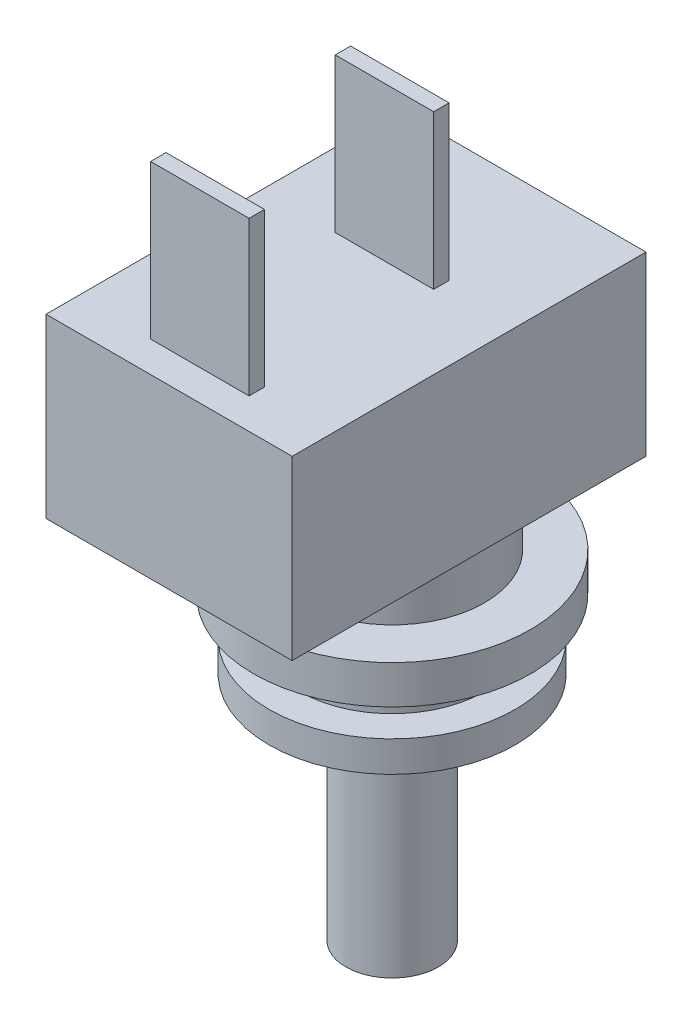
ISO-10303-21;
HEADER;
FILE_DESCRIPTION(('STEP AP214'),'2;1');
FILE_NAME('part.step','',(''),(''),'','','');
FILE_SCHEMA(('AUTOMOTIVE_DESIGN { 1 0 10303 214 1 1 1 1 }'));
ENDSEC;
DATA;
#1=APPLICATION_CONTEXT('core data for automotive mechanical design processes');
#2=APPLICATION_PROTOCOL_DEFINITION('international standard','automotive_design',2000,#1);
#3=PRODUCT_CONTEXT('',#1,'mechanical');
#4=PRODUCT('Part','Part','',(#3));
#5=PRODUCT_RELATED_PRODUCT_CATEGORY('part','',(#4));
#6=PRODUCT_DEFINITION_FORMATION('','',#4);
#7=PRODUCT_DEFINITION_CONTEXT('part definition',#1,'design');
#8=PRODUCT_DEFINITION('design','',#6,#7);
#9=PRODUCT_DEFINITION_SHAPE('','',#8);
#10=(LENGTH_UNIT() NAMED_UNIT(*) SI_UNIT(.MILLI.,.METRE.));
#11=(NAMED_UNIT(*) PLANE_ANGLE_UNIT() SI_UNIT($,.RADIAN.));
#12=(NAMED_UNIT(*) SI_UNIT($,.STERADIAN.) SOLID_ANGLE_UNIT());
#13=UNCERTAINTY_MEASURE_WITH_UNIT(LENGTH_MEASURE(1.E-05),#10,'distance_accuracy_value','');
#14=(GEOMETRIC_REPRESENTATION_CONTEXT(3) GLOBAL_UNCERTAINTY_ASSIGNED_CONTEXT((#13)) GLOBAL_UNIT_ASSIGNED_CONTEXT((#10,
#11,#12)) REPRESENTATION_CONTEXT('',''));
#15=CARTESIAN_POINT('',(0.,0.,0.));
#16=DIRECTION('',(0.,0.,1.));
#17=DIRECTION('',(1.,0.,0.));
#18=AXIS2_PLACEMENT_3D('',#15,#16,#17);
#19=CARTESIAN_POINT('',(8.,23.5,14.5));
#20=DIRECTION('',(0.,-1.,0.));
#21=DIRECTION('',(0.,0.,-1.));
#22=AXIS2_PLACEMENT_3D('',#19,#20,#21);
#23=PLANE('',#22);
#24=DIRECTION('',(0.,0.,-1.));
#25=VECTOR('',#24,1.);
#26=CARTESIAN_POINT('',(3.2,23.5,-0.5));
#27=LINE('',#26,#25);
#28=CARTESIAN_POINT('',(3.2,23.5,0.499999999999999));
#29=VERTEX_POINT('',#28);
#30=CARTESIAN_POINT('',(3.2,23.5,-0.5));
#31=VERTEX_POINT('',#30);
#32=EDGE_CURVE('E141',#29,#31,#27,.T.);
#33=ORIENTED_EDGE('',*,*,#32,.F.);
#34=DIRECTION('',(1.,0.,0.));
#35=VECTOR('',#34,1.);
#36=CARTESIAN_POINT('',(3.2,23.5,0.499999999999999));
#37=LINE('',#36,#35);
#38=CARTESIAN_POINT('',(-3.2,23.5,0.5));
#39=VERTEX_POINT('',#38);
#40=EDGE_CURVE('E154',#39,#29,#37,.T.);
#41=ORIENTED_EDGE('',*,*,#40,.F.);
#42=DIRECTION('',(0.,0.,1.));
#43=VECTOR('',#42,1.);
#44=CARTESIAN_POINT('',(-3.2,23.5,-0.5));
#45=LINE('',#44,#43);
#46=CARTESIAN_POINT('',(-3.2,23.5,-0.5));
#47=VERTEX_POINT('',#46);
#48=EDGE_CURVE('E163',#47,#39,#45,.T.);
#49=ORIENTED_EDGE('',*,*,#48,.F.);
#50=DIRECTION('',(-1.,0.,0.));
#51=VECTOR('',#50,1.);
#52=CARTESIAN_POINT('',(3.2,23.5,-0.5));
#53=LINE('',#52,#51);
#54=EDGE_CURVE('E144',#31,#47,#53,.T.);
#55=ORIENTED_EDGE('',*,*,#54,.F.);
#56=EDGE_LOOP('',(#33,#41,#49,#55));
#57=FACE_BOUND('',#56,.T.);
#58=DIRECTION('',(0.,0.,-1.));
#59=VECTOR('',#58,1.);
#60=CARTESIAN_POINT('',(8.,23.5,-8.5));
#61=LINE('',#60,#59);
#62=CARTESIAN_POINT('',(8.,23.5,14.5));
#63=VERTEX_POINT('',#62);
#64=CARTESIAN_POINT('',(8.,23.5,-8.5));
#65=VERTEX_POINT('',#64);
#66=EDGE_CURVE('E180',#63,#65,#61,.T.);
#67=ORIENTED_EDGE('',*,*,#66,.T.);
#68=DIRECTION('',(-1.,0.,0.));
#69=VECTOR('',#68,1.);
#70=CARTESIAN_POINT('',(8.,23.5,-8.5));
#71=LINE('',#70,#69);
#72=CARTESIAN_POINT('',(-8.,23.5,-8.5));
#73=VERTEX_POINT('',#72);
#74=EDGE_CURVE('E183',#65,#73,#71,.T.);
#75=ORIENTED_EDGE('',*,*,#74,.T.);
#76=DIRECTION('',(0.,0.,1.));
#77=VECTOR('',#76,1.);
#78=CARTESIAN_POINT('',(-8.,23.5,-8.5));
#79=LINE('',#78,#77);
#80=CARTESIAN_POINT('',(-7.99999999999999,23.5,14.5));
#81=VERTEX_POINT('',#80);
#82=EDGE_CURVE('E186',#73,#81,#79,.T.);
#83=ORIENTED_EDGE('',*,*,#82,.T.);
#84=DIRECTION('',(1.,0.,0.));
#85=VECTOR('',#84,1.);
#86=CARTESIAN_POINT('',(8.,23.5,14.5));
#87=LINE('',#86,#85);
#88=EDGE_CURVE('E188',#81,#63,#87,.T.);
#89=ORIENTED_EDGE('',*,*,#88,.T.);
#90=EDGE_LOOP('',(#67,#75,#83,#89));
#91=FACE_BOUND('',#90,.T.);
#92=DIRECTION('',(0.,0.,-1.));
#93=VECTOR('',#92,1.);
#94=CARTESIAN_POINT('',(3.2,23.5,12.5));
#95=LINE('',#94,#93);
#96=CARTESIAN_POINT('',(3.2,23.5,12.5));
#97=VERTEX_POINT('',#96);
#98=CARTESIAN_POINT('',(3.2,23.5,11.5));
#99=VERTEX_POINT('',#98);
#100=EDGE_CURVE('E140',#97,#99,#95,.T.);
#101=ORIENTED_EDGE('',*,*,#100,.F.);
#102=DIRECTION('',(1.,0.,0.));
#103=VECTOR('',#102,1.);
#104=CARTESIAN_POINT('',(3.2,23.5,12.5));
#105=LINE('',#104,#103);
#106=CARTESIAN_POINT('',(-3.2,23.5,12.5));
#107=VERTEX_POINT('',#106);
#108=EDGE_CURVE('E137',#107,#97,#105,.T.);
#109=ORIENTED_EDGE('',*,*,#108,.F.);
#110=DIRECTION('',(0.,0.,1.));
#111=VECTOR('',#110,1.);
#112=CARTESIAN_POINT('',(-3.2,23.5,12.5));
#113=LINE('',#112,#111);
#114=CARTESIAN_POINT('',(-3.2,23.5,11.5));
#115=VERTEX_POINT('',#114);
#116=EDGE_CURVE('E51',#115,#107,#113,.T.);
#117=ORIENTED_EDGE('',*,*,#116,.F.);
#118=DIRECTION('',(-1.,0.,0.));
#119=VECTOR('',#118,1.);
#120=CARTESIAN_POINT('',(3.2,23.5,11.5));
#121=LINE('',#120,#119);
#122=EDGE_CURVE('E46',#99,#115,#121,.T.);
#123=ORIENTED_EDGE('',*,*,#122,.F.);
#124=EDGE_LOOP('',(#101,#109,#117,#123));
#125=FACE_BOUND('',#124,.T.);
#126=ADVANCED_FACE('F31',(#57,#91,#125),#23,.F.);
#127=CARTESIAN_POINT('',(0.,7.,0.));
#128=DIRECTION('',(0.,1.,0.));
#129=DIRECTION('',(0.,0.,1.));
#130=AXIS2_PLACEMENT_3D('',#127,#128,#129);
#131=PLANE('',#130);
#132=CARTESIAN_POINT('',(0.,7.,0.));
#133=DIRECTION('',(0.,1.,0.));
#134=DIRECTION('',(0.,0.,1.));
#135=AXIS2_PLACEMENT_3D('',#132,#133,#134);
#136=CIRCLE('',#135,9.);
#137=CARTESIAN_POINT('',(0.,7.,9.));
#138=VERTEX_POINT('',#137);
#139=EDGE_CURVE('E216',#138,#138,#136,.T.);
#140=ORIENTED_EDGE('',*,*,#139,.T.);
#141=EDGE_LOOP('',(#140));
#142=FACE_BOUND('',#141,.T.);
#143=CARTESIAN_POINT('',(0.,7.,0.));
#144=DIRECTION('',(0.,1.,0.));
#145=DIRECTION('',(0.,0.,1.));
#146=AXIS2_PLACEMENT_3D('',#143,#144,#145);
#147=CIRCLE('',#146,6.);
#148=CARTESIAN_POINT('',(0.,7.,6.));
#149=VERTEX_POINT('',#148);
#150=EDGE_CURVE('E209',#149,#149,#147,.T.);
#151=ORIENTED_EDGE('',*,*,#150,.F.);
#152=EDGE_LOOP('',(#151));
#153=FACE_BOUND('',#152,.T.);
#154=ADVANCED_FACE('F264',(#142,#153),#131,.T.);
#155=CARTESIAN_POINT('',(0.,2.,0.));
#156=DIRECTION('',(0.,1.,0.));
#157=DIRECTION('',(0.,0.,1.));
#158=AXIS2_PLACEMENT_3D('',#155,#156,#157);
#159=PLANE('',#158);
#160=CARTESIAN_POINT('',(0.,2.,0.));
#161=DIRECTION('',(0.,1.,0.));
#162=DIRECTION('',(0.,0.,1.));
#163=AXIS2_PLACEMENT_3D('',#160,#161,#162);
#164=CIRCLE('',#163,8.);
#165=CARTESIAN_POINT('',(0.,2.,8.));
#166=VERTEX_POINT('',#165);
#167=EDGE_CURVE('E240',#166,#166,#164,.T.);
#168=ORIENTED_EDGE('',*,*,#167,.T.);
#169=EDGE_LOOP('',(#168));
#170=FACE_BOUND('',#169,.T.);
#171=CARTESIAN_POINT('',(0.,2.,0.));
#172=DIRECTION('',(0.,1.,0.));
#173=DIRECTION('',(0.,0.,1.));
#174=AXIS2_PLACEMENT_3D('',#171,#172,#173);
#175=CIRCLE('',#174,6.);
#176=CARTESIAN_POINT('',(0.,2.,6.));
#177=VERTEX_POINT('',#176);
#178=EDGE_CURVE('E219',#177,#177,#175,.T.);
#179=ORIENTED_EDGE('',*,*,#178,.F.);
#180=EDGE_LOOP('',(#179));
#181=FACE_BOUND('',#180,.T.);
#182=ADVANCED_FACE('F259',(#170,#181),#159,.T.);
#183=CARTESIAN_POINT('',(0.,0.,0.));
#184=DIRECTION('',(0.,1.,0.));
#185=DIRECTION('',(0.,0.,1.));
#186=AXIS2_PLACEMENT_3D('',#183,#184,#185);
#187=PLANE('',#186);
#188=CARTESIAN_POINT('',(0.,0.,0.));
#189=DIRECTION('',(0.,-1.,0.));
#190=DIRECTION('',(0.,0.,-1.));
#191=AXIS2_PLACEMENT_3D('',#188,#189,#190);
#192=CIRCLE('',#191,3.5);
#193=CARTESIAN_POINT('',(0.,0.,-3.5));
#194=VERTEX_POINT('',#193);
#195=EDGE_CURVE('E230',#194,#194,#192,.T.);
#196=ORIENTED_EDGE('',*,*,#195,.T.);
#197=EDGE_LOOP('',(#196));
#198=FACE_BOUND('',#197,.T.);
#199=CARTESIAN_POINT('',(0.,0.,0.));
#200=DIRECTION('',(0.,1.,0.));
#201=DIRECTION('',(0.,0.,1.));
#202=AXIS2_PLACEMENT_3D('',#199,#200,#201);
#203=CIRCLE('',#202,3.);
#204=CARTESIAN_POINT('',(0.,0.,3.));
#205=VERTEX_POINT('',#204);
#206=EDGE_CURVE('E11',#205,#205,#203,.F.);
#207=ORIENTED_EDGE('',*,*,#206,.F.);
#208=EDGE_LOOP('',(#207));
#209=FACE_BOUND('',#208,.T.);
#210=ADVANCED_FACE('F251',(#198,#209),#187,.F.);
#211=CARTESIAN_POINT('',(0.,0.,0.));
#212=DIRECTION('',(0.,1.,0.));
#213=DIRECTION('',(0.,0.,1.));
#214=AXIS2_PLACEMENT_3D('',#211,#212,#213);
#215=CIRCLE('',#214,8.);
#216=CARTESIAN_POINT('',(0.,0.,8.));
#217=VERTEX_POINT('',#216);
#218=EDGE_CURVE('E239',#217,#217,#215,.T.);
#219=ORIENTED_EDGE('',*,*,#218,.F.);
#220=EDGE_LOOP('',(#219));
#221=FACE_BOUND('',#220,.T.);
#222=CARTESIAN_POINT('',(0.,0.,0.));
#223=DIRECTION('',(0.,1.,0.));
#224=DIRECTION('',(0.,0.,1.));
#225=AXIS2_PLACEMENT_3D('',#222,#223,#224);
#226=CIRCLE('',#225,6.);
#227=CARTESIAN_POINT('',(0.,0.,6.));
#228=VERTEX_POINT('',#227);
#229=EDGE_CURVE('E39',#228,#228,#226,.F.);
#230=ORIENTED_EDGE('',*,*,#229,.F.);
#231=EDGE_LOOP('',(#230));
#232=FACE_BOUND('',#231,.T.);
#233=ADVANCED_FACE('F249',(#221,#232),#187,.F.);
#234=CARTESIAN_POINT('',(0.,2.,0.));
#235=DIRECTION('',(0.,-1.,0.));
#236=DIRECTION('',(0.,0.,-1.));
#237=AXIS2_PLACEMENT_3D('',#234,#235,#236);
#238=CYLINDRICAL_SURFACE('',#237,8.);
#239=ORIENTED_EDGE('',*,*,#167,.F.);
#240=EDGE_LOOP('',(#239));
#241=FACE_BOUND('',#240,.T.);
#242=ORIENTED_EDGE('',*,*,#218,.T.);
#243=EDGE_LOOP('',(#242));
#244=FACE_BOUND('',#243,.T.);
#245=ADVANCED_FACE('F33',(#241,#244),#238,.T.);
#246=CARTESIAN_POINT('',(0.,-1.,0.));
#247=DIRECTION('',(0.,-1.,0.));
#248=DIRECTION('',(0.,0.,-1.));
#249=AXIS2_PLACEMENT_3D('',#246,#247,#248);
#250=PLANE('',#249);
#251=CARTESIAN_POINT('',(0.,-1.,0.));
#252=DIRECTION('',(0.,-1.,0.));
#253=DIRECTION('',(0.,0.,-1.));
#254=AXIS2_PLACEMENT_3D('',#251,#252,#253);
#255=CIRCLE('',#254,6.);
#256=CARTESIAN_POINT('',(0.,-1.,-6.));
#257=VERTEX_POINT('',#256);
#258=EDGE_CURVE('E234',#257,#257,#255,.T.);
#259=ORIENTED_EDGE('',*,*,#258,.T.);
#260=EDGE_LOOP('',(#259));
#261=FACE_BOUND('',#260,.T.);
#262=CARTESIAN_POINT('',(0.,-1.,0.));
#263=DIRECTION('',(0.,-1.,0.));
#264=DIRECTION('',(0.,0.,-1.));
#265=AXIS2_PLACEMENT_3D('',#262,#263,#264);
#266=CIRCLE('',#265,3.5);
#267=CARTESIAN_POINT('',(0.,-1.,-3.5));
#268=VERTEX_POINT('',#267);
#269=EDGE_CURVE('E231',#268,#268,#266,.T.);
#270=ORIENTED_EDGE('',*,*,#269,.F.);
#271=EDGE_LOOP('',(#270));
#272=FACE_BOUND('',#271,.T.);
#273=ADVANCED_FACE('F257',(#261,#272),#250,.T.);
#274=CARTESIAN_POINT('',(0.,-1.,0.));
#275=DIRECTION('',(0.,1.,0.));
#276=DIRECTION('',(0.,0.,1.));
#277=AXIS2_PLACEMENT_3D('',#274,#275,#276);
#278=CYLINDRICAL_SURFACE('',#277,6.);
#279=ORIENTED_EDGE('',*,*,#258,.F.);
#280=EDGE_LOOP('',(#279));
#281=FACE_BOUND('',#280,.T.);
#282=ORIENTED_EDGE('',*,*,#229,.T.);
#283=EDGE_LOOP('',(#282));
#284=FACE_BOUND('',#283,.T.);
#285=ADVANCED_FACE('F247',(#281,#284),#278,.T.);
#286=CARTESIAN_POINT('',(0.,-1.,0.));
#287=DIRECTION('',(0.,1.,0.));
#288=DIRECTION('',(0.,0.,1.));
#289=AXIS2_PLACEMENT_3D('',#286,#287,#288);
#290=CYLINDRICAL_SURFACE('',#289,3.5);
#291=ORIENTED_EDGE('',*,*,#269,.T.);
#292=EDGE_LOOP('',(#291));
#293=FACE_BOUND('',#292,.T.);
#294=ORIENTED_EDGE('',*,*,#195,.F.);
#295=EDGE_LOOP('',(#294));
#296=FACE_BOUND('',#295,.T.);
#297=ADVANCED_FACE('F320',(#293,#296),#290,.F.);
#298=CARTESIAN_POINT('',(0.,-15.,0.));
#299=DIRECTION('',(0.,1.,0.));
#300=DIRECTION('',(0.,0.,1.));
#301=AXIS2_PLACEMENT_3D('',#298,#299,#300);
#302=CYLINDRICAL_SURFACE('',#301,3.);
#303=CARTESIAN_POINT('',(0.,-15.,0.));
#304=DIRECTION('',(0.,-1.,0.));
#305=DIRECTION('',(0.,0.,-1.));
#306=AXIS2_PLACEMENT_3D('',#303,#304,#305);
#307=CIRCLE('',#306,3.);
#308=CARTESIAN_POINT('',(0.,-15.,-3.));
#309=VERTEX_POINT('',#308);
#310=EDGE_CURVE('E225',#309,#309,#307,.T.);
#311=ORIENTED_EDGE('',*,*,#310,.F.);
#312=EDGE_LOOP('',(#311));
#313=FACE_BOUND('',#312,.T.);
#314=ORIENTED_EDGE('',*,*,#206,.T.);
#315=EDGE_LOOP('',(#314));
#316=FACE_BOUND('',#315,.T.);
#317=ADVANCED_FACE('F316',(#313,#316),#302,.T.);
#318=CARTESIAN_POINT('',(0.,-15.,0.));
#319=DIRECTION('',(0.,-1.,0.));
#320=DIRECTION('',(0.,0.,-1.));
#321=AXIS2_PLACEMENT_3D('',#318,#319,#320);
#322=PLANE('',#321);
#323=ORIENTED_EDGE('',*,*,#310,.T.);
#324=EDGE_LOOP('',(#323));
#325=FACE_BOUND('',#324,.T.);
#326=ADVANCED_FACE('F312',(#325),#322,.T.);
#327=CARTESIAN_POINT('',(0.,4.5,0.));
#328=DIRECTION('',(0.,-1.,0.));
#329=DIRECTION('',(0.,0.,-1.));
#330=AXIS2_PLACEMENT_3D('',#327,#328,#329);
#331=CYLINDRICAL_SURFACE('',#330,6.);
#332=CARTESIAN_POINT('',(0.,4.5,0.));
#333=DIRECTION('',(0.,1.,0.));
#334=DIRECTION('',(0.,0.,1.));
#335=AXIS2_PLACEMENT_3D('',#332,#333,#334);
#336=CIRCLE('',#335,6.);
#337=CARTESIAN_POINT('',(0.,4.5,6.));
#338=VERTEX_POINT('',#337);
#339=EDGE_CURVE('E222',#338,#338,#336,.T.);
#340=ORIENTED_EDGE('',*,*,#339,.F.);
#341=EDGE_LOOP('',(#340));
#342=FACE_BOUND('',#341,.T.);
#343=ORIENTED_EDGE('',*,*,#178,.T.);
#344=EDGE_LOOP('',(#343));
#345=FACE_BOUND('',#344,.T.);
#346=ADVANCED_FACE('F305',(#342,#345),#331,.T.);
#347=CARTESIAN_POINT('',(0.,4.5,0.));
#348=DIRECTION('',(0.,1.,0.));
#349=DIRECTION('',(0.,0.,1.));
#350=AXIS2_PLACEMENT_3D('',#347,#348,#349);
#351=PLANE('',#350);
#352=CARTESIAN_POINT('',(0.,4.5,0.));
#353=DIRECTION('',(0.,1.,0.));
#354=DIRECTION('',(0.,0.,1.));
#355=AXIS2_PLACEMENT_3D('',#352,#353,#354);
#356=CIRCLE('',#355,9.);
#357=CARTESIAN_POINT('',(0.,4.5,9.));
#358=VERTEX_POINT('',#357);
#359=EDGE_CURVE('E213',#358,#358,#356,.T.);
#360=ORIENTED_EDGE('',*,*,#359,.F.);
#361=EDGE_LOOP('',(#360));
#362=FACE_BOUND('',#361,.T.);
#363=ORIENTED_EDGE('',*,*,#339,.T.);
#364=EDGE_LOOP('',(#363));
#365=FACE_BOUND('',#364,.T.);
#366=ADVANCED_FACE('F302',(#362,#365),#351,.F.);
#367=CARTESIAN_POINT('',(0.,7.,0.));
#368=DIRECTION('',(0.,-1.,0.));
#369=DIRECTION('',(0.,0.,-1.));
#370=AXIS2_PLACEMENT_3D('',#367,#368,#369);
#371=CYLINDRICAL_SURFACE('',#370,9.);
#372=ORIENTED_EDGE('',*,*,#139,.F.);
#373=EDGE_LOOP('',(#372));
#374=FACE_BOUND('',#373,.T.);
#375=ORIENTED_EDGE('',*,*,#359,.T.);
#376=EDGE_LOOP('',(#375));
#377=FACE_BOUND('',#376,.T.);
#378=ADVANCED_FACE('F299',(#374,#377),#371,.T.);
#379=CARTESIAN_POINT('',(0.,12.,0.));
#380=DIRECTION('',(0.,-1.,0.));
#381=DIRECTION('',(0.,0.,-1.));
#382=AXIS2_PLACEMENT_3D('',#379,#380,#381);
#383=CYLINDRICAL_SURFACE('',#382,6.);
#384=CARTESIAN_POINT('',(0.,12.,0.));
#385=DIRECTION('',(0.,1.,0.));
#386=DIRECTION('',(0.,0.,1.));
#387=AXIS2_PLACEMENT_3D('',#384,#385,#386);
#388=CIRCLE('',#387,6.);
#389=CARTESIAN_POINT('',(0.,12.,6.));
#390=VERTEX_POINT('',#389);
#391=EDGE_CURVE('E210',#390,#390,#388,.T.);
#392=ORIENTED_EDGE('',*,*,#391,.F.);
#393=EDGE_LOOP('',(#392));
#394=FACE_BOUND('',#393,.T.);
#395=ORIENTED_EDGE('',*,*,#150,.T.);
#396=EDGE_LOOP('',(#395));
#397=FACE_BOUND('',#396,.T.);
#398=ADVANCED_FACE('F281',(#394,#397),#383,.T.);
#399=CARTESIAN_POINT('',(8.,12.,14.5));
#400=DIRECTION('',(0.,-1.,0.));
#401=DIRECTION('',(0.,0.,-1.));
#402=AXIS2_PLACEMENT_3D('',#399,#400,#401);
#403=PLANE('',#402);
#404=DIRECTION('',(0.,0.,-1.));
#405=VECTOR('',#404,1.);
#406=CARTESIAN_POINT('',(8.,12.,-8.5));
#407=LINE('',#406,#405);
#408=CARTESIAN_POINT('',(8.,12.,14.5));
#409=VERTEX_POINT('',#408);
#410=CARTESIAN_POINT('',(8.,12.,-8.5));
#411=VERTEX_POINT('',#410);
#412=EDGE_CURVE('E179',#409,#411,#407,.T.);
#413=ORIENTED_EDGE('',*,*,#412,.F.);
#414=DIRECTION('',(1.,0.,0.));
#415=VECTOR('',#414,1.);
#416=CARTESIAN_POINT('',(8.,12.,14.5));
#417=LINE('',#416,#415);
#418=CARTESIAN_POINT('',(-7.99999999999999,12.,14.5));
#419=VERTEX_POINT('',#418);
#420=EDGE_CURVE('E184',#419,#409,#417,.T.);
#421=ORIENTED_EDGE('',*,*,#420,.F.);
#422=DIRECTION('',(0.,0.,1.));
#423=VECTOR('',#422,1.);
#424=CARTESIAN_POINT('',(-8.,12.,-8.5));
#425=LINE('',#424,#423);
#426=CARTESIAN_POINT('',(-8.,12.,-8.5));
#427=VERTEX_POINT('',#426);
#428=EDGE_CURVE('E195',#427,#419,#425,.T.);
#429=ORIENTED_EDGE('',*,*,#428,.F.);
#430=DIRECTION('',(-1.,0.,0.));
#431=VECTOR('',#430,1.);
#432=CARTESIAN_POINT('',(8.,12.,-8.5));
#433=LINE('',#432,#431);
#434=EDGE_CURVE('E193',#411,#427,#433,.T.);
#435=ORIENTED_EDGE('',*,*,#434,.F.);
#436=EDGE_LOOP('',(#413,#421,#429,#435));
#437=FACE_BOUND('',#436,.T.);
#438=ORIENTED_EDGE('',*,*,#391,.T.);
#439=EDGE_LOOP('',(#438));
#440=FACE_BOUND('',#439,.T.);
#441=ADVANCED_FACE('F277',(#437,#440),#403,.T.);
#442=CARTESIAN_POINT('',(8.,23.5,-8.5));
#443=DIRECTION('',(-1.,0.,0.));
#444=DIRECTION('',(0.,0.,1.));
#445=AXIS2_PLACEMENT_3D('',#442,#443,#444);
#446=PLANE('',#445);
#447=ORIENTED_EDGE('',*,*,#412,.T.);
#448=DIRECTION('',(0.,-1.,0.));
#449=VECTOR('',#448,1.);
#450=CARTESIAN_POINT('',(8.,23.5,-8.5));
#451=LINE('',#450,#449);
#452=EDGE_CURVE('E206',#65,#411,#451,.T.);
#453=ORIENTED_EDGE('',*,*,#452,.F.);
#454=ORIENTED_EDGE('',*,*,#66,.F.);
#455=DIRECTION('',(0.,-1.,0.));
#456=VECTOR('',#455,1.);
#457=CARTESIAN_POINT('',(8.,23.5,14.5));
#458=LINE('',#457,#456);
#459=EDGE_CURVE('E190',#63,#409,#458,.T.);
#460=ORIENTED_EDGE('',*,*,#459,.T.);
#461=EDGE_LOOP('',(#447,#453,#454,#460));
#462=FACE_BOUND('',#461,.T.);
#463=ADVANCED_FACE('F280',(#462),#446,.F.);
#464=CARTESIAN_POINT('',(8.,23.5,-8.5));
#465=DIRECTION('',(0.,0.,1.));
#466=DIRECTION('',(1.,0.,0.));
#467=AXIS2_PLACEMENT_3D('',#464,#465,#466);
#468=PLANE('',#467);
#469=ORIENTED_EDGE('',*,*,#434,.T.);
#470=DIRECTION('',(0.,-1.,0.));
#471=VECTOR('',#470,1.);
#472=CARTESIAN_POINT('',(-8.,23.5,-8.5));
#473=LINE('',#472,#471);
#474=EDGE_CURVE('E203',#73,#427,#473,.T.);
#475=ORIENTED_EDGE('',*,*,#474,.F.);
#476=ORIENTED_EDGE('',*,*,#74,.F.);
#477=ORIENTED_EDGE('',*,*,#452,.T.);
#478=EDGE_LOOP('',(#469,#475,#476,#477));
#479=FACE_BOUND('',#478,.T.);
#480=ADVANCED_FACE('F290',(#479),#468,.F.);
#481=CARTESIAN_POINT('',(-8.,23.5,-8.5));
#482=DIRECTION('',(1.,0.,0.));
#483=DIRECTION('',(0.,0.,-1.));
#484=AXIS2_PLACEMENT_3D('',#481,#482,#483);
#485=PLANE('',#484);
#486=ORIENTED_EDGE('',*,*,#428,.T.);
#487=DIRECTION('',(0.,-1.,0.));
#488=VECTOR('',#487,1.);
#489=CARTESIAN_POINT('',(-7.99999999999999,23.5,14.5));
#490=LINE('',#489,#488);
#491=EDGE_CURVE('E200',#81,#419,#490,.T.);
#492=ORIENTED_EDGE('',*,*,#491,.F.);
#493=ORIENTED_EDGE('',*,*,#82,.F.);
#494=ORIENTED_EDGE('',*,*,#474,.T.);
#495=EDGE_LOOP('',(#486,#492,#493,#494));
#496=FACE_BOUND('',#495,.T.);
#497=ADVANCED_FACE('F286',(#496),#485,.F.);
#498=CARTESIAN_POINT('',(8.,23.5,14.5));
#499=DIRECTION('',(0.,0.,-1.));
#500=DIRECTION('',(-1.,0.,0.));
#501=AXIS2_PLACEMENT_3D('',#498,#499,#500);
#502=PLANE('',#501);
#503=ORIENTED_EDGE('',*,*,#420,.T.);
#504=ORIENTED_EDGE('',*,*,#459,.F.);
#505=ORIENTED_EDGE('',*,*,#88,.F.);
#506=ORIENTED_EDGE('',*,*,#491,.T.);
#507=EDGE_LOOP('',(#503,#504,#505,#506));
#508=FACE_BOUND('',#507,.T.);
#509=ADVANCED_FACE('F283',(#508),#502,.F.);
#510=CARTESIAN_POINT('',(3.2,33.5,-0.5));
#511=DIRECTION('',(-1.,0.,0.));
#512=DIRECTION('',(0.,0.,1.));
#513=AXIS2_PLACEMENT_3D('',#510,#511,#512);
#514=PLANE('',#513);
#515=ORIENTED_EDGE('',*,*,#32,.T.);
#516=DIRECTION('',(0.,-1.,0.));
#517=VECTOR('',#516,1.);
#518=CARTESIAN_POINT('',(3.2,33.5,-0.5));
#519=LINE('',#518,#517);
#520=CARTESIAN_POINT('',(3.2,33.5,-0.5));
#521=VERTEX_POINT('',#520);
#522=EDGE_CURVE('E176',#521,#31,#519,.T.);
#523=ORIENTED_EDGE('',*,*,#522,.F.);
#524=DIRECTION('',(0.,0.,-1.));
#525=VECTOR('',#524,1.);
#526=CARTESIAN_POINT('',(3.2,33.5,-0.5));
#527=LINE('',#526,#525);
#528=CARTESIAN_POINT('',(3.2,33.5,0.499999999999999));
#529=VERTEX_POINT('',#528);
#530=EDGE_CURVE('E150',#529,#521,#527,.T.);
#531=ORIENTED_EDGE('',*,*,#530,.F.);
#532=DIRECTION('',(0.,-1.,0.));
#533=VECTOR('',#532,1.);
#534=CARTESIAN_POINT('',(3.2,33.5,0.499999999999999));
#535=LINE('',#534,#533);
#536=EDGE_CURVE('E159',#529,#29,#535,.T.);
#537=ORIENTED_EDGE('',*,*,#536,.T.);
#538=EDGE_LOOP('',(#515,#523,#531,#537));
#539=FACE_BOUND('',#538,.T.);
#540=ADVANCED_FACE('F275',(#539),#514,.F.);
#541=CARTESIAN_POINT('',(3.2,33.5,-0.5));
#542=DIRECTION('',(0.,0.,1.));
#543=DIRECTION('',(1.,0.,0.));
#544=AXIS2_PLACEMENT_3D('',#541,#542,#543);
#545=PLANE('',#544);
#546=ORIENTED_EDGE('',*,*,#54,.T.);
#547=DIRECTION('',(0.,-1.,0.));
#548=VECTOR('',#547,1.);
#549=CARTESIAN_POINT('',(-3.2,33.5,-0.5));
#550=LINE('',#549,#548);
#551=CARTESIAN_POINT('',(-3.2,33.5,-0.5));
#552=VERTEX_POINT('',#551);
#553=EDGE_CURVE('E173',#552,#47,#550,.T.);
#554=ORIENTED_EDGE('',*,*,#553,.F.);
#555=DIRECTION('',(-1.,0.,0.));
#556=VECTOR('',#555,1.);
#557=CARTESIAN_POINT('',(3.2,33.5,-0.5));
#558=LINE('',#557,#556);
#559=EDGE_CURVE('E153',#521,#552,#558,.T.);
#560=ORIENTED_EDGE('',*,*,#559,.F.);
#561=ORIENTED_EDGE('',*,*,#522,.T.);
#562=EDGE_LOOP('',(#546,#554,#560,#561));
#563=FACE_BOUND('',#562,.T.);
#564=ADVANCED_FACE('F405',(#563),#545,.F.);
#565=CARTESIAN_POINT('',(-3.2,33.5,-0.5));
#566=DIRECTION('',(1.,0.,0.));
#567=DIRECTION('',(0.,0.,-1.));
#568=AXIS2_PLACEMENT_3D('',#565,#566,#567);
#569=PLANE('',#568);
#570=ORIENTED_EDGE('',*,*,#48,.T.);
#571=DIRECTION('',(0.,-1.,0.));
#572=VECTOR('',#571,1.);
#573=CARTESIAN_POINT('',(-3.2,33.5,0.5));
#574=LINE('',#573,#572);
#575=CARTESIAN_POINT('',(-3.2,33.5,0.5));
#576=VERTEX_POINT('',#575);
#577=EDGE_CURVE('E170',#576,#39,#574,.T.);
#578=ORIENTED_EDGE('',*,*,#577,.F.);
#579=DIRECTION('',(0.,0.,1.));
#580=VECTOR('',#579,1.);
#581=CARTESIAN_POINT('',(-3.2,33.5,-0.5));
#582=LINE('',#581,#580);
#583=EDGE_CURVE('E156',#552,#576,#582,.T.);
#584=ORIENTED_EDGE('',*,*,#583,.F.);
#585=ORIENTED_EDGE('',*,*,#553,.T.);
#586=EDGE_LOOP('',(#570,#578,#584,#585));
#587=FACE_BOUND('',#586,.T.);
#588=ADVANCED_FACE('F412',(#587),#569,.F.);
#589=CARTESIAN_POINT('',(3.2,33.5,0.499999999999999));
#590=DIRECTION('',(0.,0.,-1.));
#591=DIRECTION('',(-1.,0.,0.));
#592=AXIS2_PLACEMENT_3D('',#589,#590,#591);
#593=PLANE('',#592);
#594=ORIENTED_EDGE('',*,*,#40,.T.);
#595=ORIENTED_EDGE('',*,*,#536,.F.);
#596=DIRECTION('',(1.,0.,0.));
#597=VECTOR('',#596,1.);
#598=CARTESIAN_POINT('',(3.2,33.5,0.499999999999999));
#599=LINE('',#598,#597);
#600=EDGE_CURVE('E158',#576,#529,#599,.T.);
#601=ORIENTED_EDGE('',*,*,#600,.F.);
#602=ORIENTED_EDGE('',*,*,#577,.T.);
#603=EDGE_LOOP('',(#594,#595,#601,#602));
#604=FACE_BOUND('',#603,.T.);
#605=ADVANCED_FACE('F419',(#604),#593,.F.);
#606=CARTESIAN_POINT('',(3.2,33.5,0.499999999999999));
#607=DIRECTION('',(0.,-1.,0.));
#608=DIRECTION('',(0.,0.,-1.));
#609=AXIS2_PLACEMENT_3D('',#606,#607,#608);
#610=PLANE('',#609);
#611=ORIENTED_EDGE('',*,*,#530,.T.);
#612=ORIENTED_EDGE('',*,*,#559,.T.);
#613=ORIENTED_EDGE('',*,*,#583,.T.);
#614=ORIENTED_EDGE('',*,*,#600,.T.);
#615=EDGE_LOOP('',(#611,#612,#613,#614));
#616=FACE_BOUND('',#615,.T.);
#617=ADVANCED_FACE('F427',(#616),#610,.F.);
#618=CARTESIAN_POINT('',(3.2,33.5,12.5));
#619=DIRECTION('',(-1.,0.,0.));
#620=DIRECTION('',(0.,0.,1.));
#621=AXIS2_PLACEMENT_3D('',#618,#619,#620);
#622=PLANE('',#621);
#623=ORIENTED_EDGE('',*,*,#100,.T.);
#624=DIRECTION('',(0.,-1.,0.));
#625=VECTOR('',#624,1.);
#626=CARTESIAN_POINT('',(3.2,33.5,11.5));
#627=LINE('',#626,#625);
#628=CARTESIAN_POINT('',(3.2,33.5,11.5));
#629=VERTEX_POINT('',#628);
#630=EDGE_CURVE('E121',#629,#99,#627,.T.);
#631=ORIENTED_EDGE('',*,*,#630,.F.);
#632=DIRECTION('',(0.,0.,-1.));
#633=VECTOR('',#632,1.);
#634=CARTESIAN_POINT('',(3.2,33.5,12.5));
#635=LINE('',#634,#633);
#636=CARTESIAN_POINT('',(3.2,33.5,12.5));
#637=VERTEX_POINT('',#636);
#638=EDGE_CURVE('E128',#637,#629,#635,.T.);
#639=ORIENTED_EDGE('',*,*,#638,.F.);
#640=DIRECTION('',(0.,-1.,0.));
#641=VECTOR('',#640,1.);
#642=CARTESIAN_POINT('',(3.2,33.5,12.5));
#643=LINE('',#642,#641);
#644=EDGE_CURVE('E522',#637,#97,#643,.T.);
#645=ORIENTED_EDGE('',*,*,#644,.T.);
#646=EDGE_LOOP('',(#623,#631,#639,#645));
#647=FACE_BOUND('',#646,.T.);
#648=ADVANCED_FACE('F139',(#647),#622,.F.);
#649=CARTESIAN_POINT('',(3.2,33.5,11.5));
#650=DIRECTION('',(0.,0.,1.));
#651=DIRECTION('',(1.,0.,0.));
#652=AXIS2_PLACEMENT_3D('',#649,#650,#651);
#653=PLANE('',#652);
#654=ORIENTED_EDGE('',*,*,#122,.T.);
#655=DIRECTION('',(0.,-1.,0.));
#656=VECTOR('',#655,1.);
#657=CARTESIAN_POINT('',(-3.2,33.5,11.5));
#658=LINE('',#657,#656);
#659=CARTESIAN_POINT('',(-3.2,33.5,11.5));
#660=VERTEX_POINT('',#659);
#661=EDGE_CURVE('E124',#660,#115,#658,.T.);
#662=ORIENTED_EDGE('',*,*,#661,.F.);
#663=DIRECTION('',(-1.,0.,0.));
#664=VECTOR('',#663,1.);
#665=CARTESIAN_POINT('',(3.2,33.5,11.5));
#666=LINE('',#665,#664);
#667=EDGE_CURVE('E117',#629,#660,#666,.T.);
#668=ORIENTED_EDGE('',*,*,#667,.F.);
#669=ORIENTED_EDGE('',*,*,#630,.T.);
#670=EDGE_LOOP('',(#654,#662,#668,#669));
#671=FACE_BOUND('',#670,.T.);
#672=ADVANCED_FACE('F119',(#671),#653,.F.);
#673=CARTESIAN_POINT('',(-3.2,33.5,12.5));
#674=DIRECTION('',(1.,0.,0.));
#675=DIRECTION('',(0.,0.,-1.));
#676=AXIS2_PLACEMENT_3D('',#673,#674,#675);
#677=PLANE('',#676);
#678=ORIENTED_EDGE('',*,*,#116,.T.);
#679=DIRECTION('',(0.,-1.,0.));
#680=VECTOR('',#679,1.);
#681=CARTESIAN_POINT('',(-3.2,33.5,12.5));
#682=LINE('',#681,#680);
#683=CARTESIAN_POINT('',(-3.2,33.5,12.5));
#684=VERTEX_POINT('',#683);
#685=EDGE_CURVE('E146',#684,#107,#682,.T.);
#686=ORIENTED_EDGE('',*,*,#685,.F.);
#687=DIRECTION('',(0.,0.,1.));
#688=VECTOR('',#687,1.);
#689=CARTESIAN_POINT('',(-3.2,33.5,12.5));
#690=LINE('',#689,#688);
#691=EDGE_CURVE('E127',#660,#684,#690,.T.);
#692=ORIENTED_EDGE('',*,*,#691,.F.);
#693=ORIENTED_EDGE('',*,*,#661,.T.);
#694=EDGE_LOOP('',(#678,#686,#692,#693));
#695=FACE_BOUND('',#694,.T.);
#696=ADVANCED_FACE('F448',(#695),#677,.F.);
#697=CARTESIAN_POINT('',(3.2,33.5,12.5));
#698=DIRECTION('',(0.,0.,-1.));
#699=DIRECTION('',(-1.,0.,0.));
#700=AXIS2_PLACEMENT_3D('',#697,#698,#699);
#701=PLANE('',#700);
#702=ORIENTED_EDGE('',*,*,#108,.T.);
#703=ORIENTED_EDGE('',*,*,#644,.F.);
#704=DIRECTION('',(1.,0.,0.));
#705=VECTOR('',#704,1.);
#706=CARTESIAN_POINT('',(3.2,33.5,12.5));
#707=LINE('',#706,#705);
#708=EDGE_CURVE('E133',#684,#637,#707,.T.);
#709=ORIENTED_EDGE('',*,*,#708,.F.);
#710=ORIENTED_EDGE('',*,*,#685,.T.);
#711=EDGE_LOOP('',(#702,#703,#709,#710));
#712=FACE_BOUND('',#711,.T.);
#713=ADVANCED_FACE('F455',(#712),#701,.F.);
#714=CARTESIAN_POINT('',(3.2,33.5,11.5));
#715=DIRECTION('',(0.,1.,0.));
#716=DIRECTION('',(0.,0.,1.));
#717=AXIS2_PLACEMENT_3D('',#714,#715,#716);
#718=PLANE('',#717);
#719=ORIENTED_EDGE('',*,*,#638,.T.);
#720=ORIENTED_EDGE('',*,*,#667,.T.);
#721=ORIENTED_EDGE('',*,*,#691,.T.);
#722=ORIENTED_EDGE('',*,*,#708,.T.);
#723=EDGE_LOOP('',(#719,#720,#721,#722));
#724=FACE_BOUND('',#723,.T.);
#725=ADVANCED_FACE('F131',(#724),#718,.T.);
#726=CLOSED_SHELL('',(#126,#154,#182,#210,#233,#245,#273,#285,#297,#317,#326,#346,#366,#378,
#398,#441,#463,#480,#497,#509,#540,#564,#588,#605,#617,#648,#672,#696,#713,#725));
#727=MANIFOLD_SOLID_BREP('B2',#726);
#728=ADVANCED_BREP_SHAPE_REPRESENTATION('',(#18,#727),#14);
#729=SHAPE_DEFINITION_REPRESENTATION(#9,#728);
ENDSEC;
END-ISO-10303-21;
